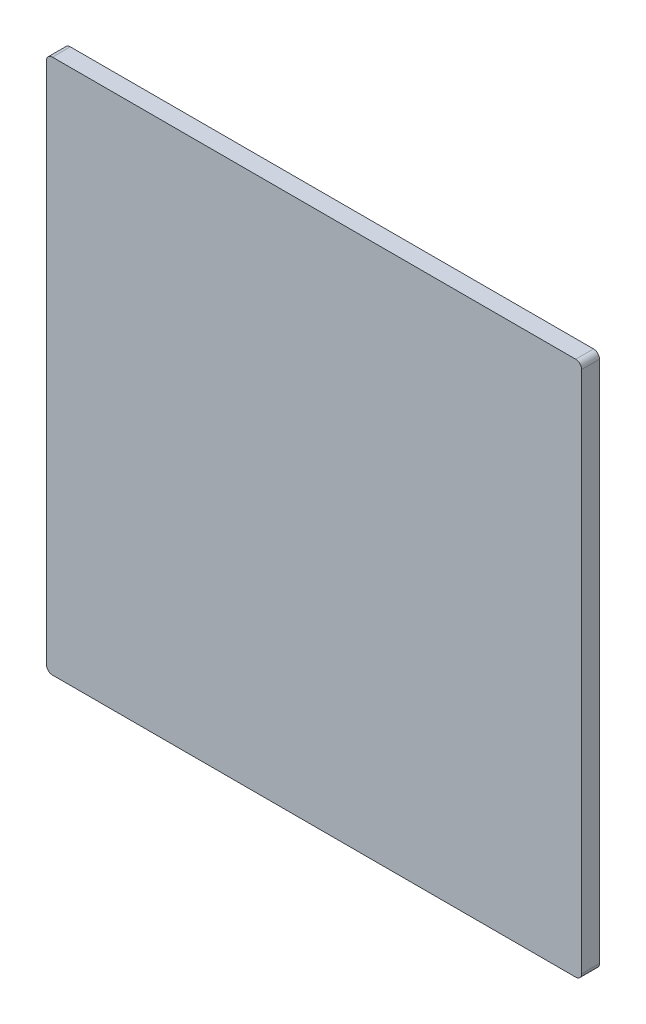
ISO-10303-21;
HEADER;
FILE_DESCRIPTION(('STEP AP214'),'2;1');
FILE_NAME('part.step','',(''),(''),'','','');
FILE_SCHEMA(('AUTOMOTIVE_DESIGN { 1 0 10303 214 1 1 1 1 }'));
ENDSEC;
DATA;
#1=APPLICATION_CONTEXT('core data for automotive mechanical design processes');
#2=APPLICATION_PROTOCOL_DEFINITION('international standard','automotive_design',2000,#1);
#3=PRODUCT_CONTEXT('',#1,'mechanical');
#4=PRODUCT('Part','Part','',(#3));
#5=PRODUCT_RELATED_PRODUCT_CATEGORY('part','',(#4));
#6=PRODUCT_DEFINITION_FORMATION('','',#4);
#7=PRODUCT_DEFINITION_CONTEXT('part definition',#1,'design');
#8=PRODUCT_DEFINITION('design','',#6,#7);
#9=PRODUCT_DEFINITION_SHAPE('','',#8);
#10=(LENGTH_UNIT() NAMED_UNIT(*) SI_UNIT(.MILLI.,.METRE.));
#11=(NAMED_UNIT(*) PLANE_ANGLE_UNIT() SI_UNIT($,.RADIAN.));
#12=(NAMED_UNIT(*) SI_UNIT($,.STERADIAN.) SOLID_ANGLE_UNIT());
#13=UNCERTAINTY_MEASURE_WITH_UNIT(LENGTH_MEASURE(1.E-05),#10,'distance_accuracy_value','');
#14=(GEOMETRIC_REPRESENTATION_CONTEXT(3) GLOBAL_UNCERTAINTY_ASSIGNED_CONTEXT((#13)) GLOBAL_UNIT_ASSIGNED_CONTEXT((#10,
#11,#12)) REPRESENTATION_CONTEXT('',''));
#15=CARTESIAN_POINT('',(0.,0.,0.));
#16=DIRECTION('',(0.,0.,1.));
#17=DIRECTION('',(1.,0.,0.));
#18=AXIS2_PLACEMENT_3D('',#15,#16,#17);
#19=CARTESIAN_POINT('',(114.3,-114.3,7.62));
#20=DIRECTION('',(-1.,0.,0.));
#21=DIRECTION('',(0.,0.,1.));
#22=AXIS2_PLACEMENT_3D('',#19,#20,#21);
#23=PLANE('',#22);
#24=DIRECTION('',(0.,1.,0.));
#25=VECTOR('',#24,1.);
#26=CARTESIAN_POINT('',(114.3,-114.3,7.62));
#27=LINE('',#26,#25);
#28=CARTESIAN_POINT('',(114.3,-111.76,7.62));
#29=VERTEX_POINT('',#28);
#30=CARTESIAN_POINT('',(114.3,111.76,7.62));
#31=VERTEX_POINT('',#30);
#32=EDGE_CURVE('E134',#29,#31,#27,.T.);
#33=ORIENTED_EDGE('',*,*,#32,.F.);
#34=DIRECTION('',(0.,0.,-1.));
#35=VECTOR('',#34,1.);
#36=CARTESIAN_POINT('',(114.3,-111.76,7.62));
#37=LINE('',#36,#35);
#38=CARTESIAN_POINT('',(114.3,-111.76,0.));
#39=VERTEX_POINT('',#38);
#40=EDGE_CURVE('E173',#29,#39,#37,.T.);
#41=ORIENTED_EDGE('',*,*,#40,.T.);
#42=DIRECTION('',(0.,1.,0.));
#43=VECTOR('',#42,1.);
#44=CARTESIAN_POINT('',(114.3,-114.3,0.));
#45=LINE('',#44,#43);
#46=CARTESIAN_POINT('',(114.3,111.76,0.));
#47=VERTEX_POINT('',#46);
#48=EDGE_CURVE('E184',#39,#47,#45,.T.);
#49=ORIENTED_EDGE('',*,*,#48,.T.);
#50=DIRECTION('',(0.,0.,-1.));
#51=VECTOR('',#50,1.);
#52=CARTESIAN_POINT('',(114.3,111.76,7.62));
#53=LINE('',#52,#51);
#54=EDGE_CURVE('E170',#47,#31,#53,.F.);
#55=ORIENTED_EDGE('',*,*,#54,.T.);
#56=EDGE_LOOP('',(#33,#41,#49,#55));
#57=FACE_BOUND('',#56,.T.);
#58=ADVANCED_FACE('F39',(#57),#23,.F.);
#59=CARTESIAN_POINT('',(-114.3,114.3,7.62));
#60=DIRECTION('',(0.,-1.,0.));
#61=DIRECTION('',(0.,0.,-1.));
#62=AXIS2_PLACEMENT_3D('',#59,#60,#61);
#63=PLANE('',#62);
#64=DIRECTION('',(-1.,0.,0.));
#65=VECTOR('',#64,1.);
#66=CARTESIAN_POINT('',(-114.3,114.3,0.));
#67=LINE('',#66,#65);
#68=CARTESIAN_POINT('',(111.76,114.3,0.));
#69=VERTEX_POINT('',#68);
#70=CARTESIAN_POINT('',(-111.76,114.3,0.));
#71=VERTEX_POINT('',#70);
#72=EDGE_CURVE('E141',#69,#71,#67,.T.);
#73=ORIENTED_EDGE('',*,*,#72,.T.);
#74=DIRECTION('',(0.,0.,-1.));
#75=VECTOR('',#74,1.);
#76=CARTESIAN_POINT('',(-111.76,114.3,7.62));
#77=LINE('',#76,#75);
#78=CARTESIAN_POINT('',(-111.76,114.3,7.62));
#79=VERTEX_POINT('',#78);
#80=EDGE_CURVE('E11',#71,#79,#77,.F.);
#81=ORIENTED_EDGE('',*,*,#80,.T.);
#82=DIRECTION('',(-1.,0.,0.));
#83=VECTOR('',#82,1.);
#84=CARTESIAN_POINT('',(-114.3,114.3,7.62));
#85=LINE('',#84,#83);
#86=CARTESIAN_POINT('',(111.76,114.3,7.62));
#87=VERTEX_POINT('',#86);
#88=EDGE_CURVE('E139',#87,#79,#85,.T.);
#89=ORIENTED_EDGE('',*,*,#88,.F.);
#90=DIRECTION('',(0.,0.,-1.));
#91=VECTOR('',#90,1.);
#92=CARTESIAN_POINT('',(111.76,114.3,7.62));
#93=LINE('',#92,#91);
#94=EDGE_CURVE('E48',#87,#69,#93,.T.);
#95=ORIENTED_EDGE('',*,*,#94,.T.);
#96=EDGE_LOOP('',(#73,#81,#89,#95));
#97=FACE_BOUND('',#96,.T.);
#98=ADVANCED_FACE('F180',(#97),#63,.F.);
#99=CARTESIAN_POINT('',(-114.3,-114.3,7.62));
#100=DIRECTION('',(1.,0.,0.));
#101=DIRECTION('',(0.,0.,-1.));
#102=AXIS2_PLACEMENT_3D('',#99,#100,#101);
#103=PLANE('',#102);
#104=DIRECTION('',(0.,-1.,0.));
#105=VECTOR('',#104,1.);
#106=CARTESIAN_POINT('',(-114.3,-114.3,0.));
#107=LINE('',#106,#105);
#108=CARTESIAN_POINT('',(-114.3,111.76,0.));
#109=VERTEX_POINT('',#108);
#110=CARTESIAN_POINT('',(-114.3,-111.76,0.));
#111=VERTEX_POINT('',#110);
#112=EDGE_CURVE('E135',#109,#111,#107,.T.);
#113=ORIENTED_EDGE('',*,*,#112,.T.);
#114=DIRECTION('',(0.,0.,-1.));
#115=VECTOR('',#114,1.);
#116=CARTESIAN_POINT('',(-114.3,-111.76,7.62));
#117=LINE('',#116,#115);
#118=CARTESIAN_POINT('',(-114.3,-111.76,7.62));
#119=VERTEX_POINT('',#118);
#120=EDGE_CURVE('E110',#111,#119,#117,.F.);
#121=ORIENTED_EDGE('',*,*,#120,.T.);
#122=DIRECTION('',(0.,-1.,0.));
#123=VECTOR('',#122,1.);
#124=CARTESIAN_POINT('',(-114.3,-114.3,7.62));
#125=LINE('',#124,#123);
#126=CARTESIAN_POINT('',(-114.3,111.76,7.62));
#127=VERTEX_POINT('',#126);
#128=EDGE_CURVE('E190',#127,#119,#125,.T.);
#129=ORIENTED_EDGE('',*,*,#128,.F.);
#130=DIRECTION('',(0.,0.,-1.));
#131=VECTOR('',#130,1.);
#132=CARTESIAN_POINT('',(-114.3,111.76,7.62));
#133=LINE('',#132,#131);
#134=EDGE_CURVE('E116',#127,#109,#133,.T.);
#135=ORIENTED_EDGE('',*,*,#134,.T.);
#136=EDGE_LOOP('',(#113,#121,#129,#135));
#137=FACE_BOUND('',#136,.T.);
#138=ADVANCED_FACE('F202',(#137),#103,.F.);
#139=CARTESIAN_POINT('',(-114.3,-114.3,7.62));
#140=DIRECTION('',(0.,1.,0.));
#141=DIRECTION('',(0.,0.,1.));
#142=AXIS2_PLACEMENT_3D('',#139,#140,#141);
#143=PLANE('',#142);
#144=DIRECTION('',(1.,0.,0.));
#145=VECTOR('',#144,1.);
#146=CARTESIAN_POINT('',(-114.3,-114.3,7.62));
#147=LINE('',#146,#145);
#148=CARTESIAN_POINT('',(-111.76,-114.3,7.62));
#149=VERTEX_POINT('',#148);
#150=CARTESIAN_POINT('',(111.76,-114.3,7.62));
#151=VERTEX_POINT('',#150);
#152=EDGE_CURVE('E126',#149,#151,#147,.T.);
#153=ORIENTED_EDGE('',*,*,#152,.F.);
#154=DIRECTION('',(0.,0.,-1.));
#155=VECTOR('',#154,1.);
#156=CARTESIAN_POINT('',(-111.76,-114.3,7.62));
#157=LINE('',#156,#155);
#158=CARTESIAN_POINT('',(-111.76,-114.3,0.));
#159=VERTEX_POINT('',#158);
#160=EDGE_CURVE('E109',#149,#159,#157,.T.);
#161=ORIENTED_EDGE('',*,*,#160,.T.);
#162=DIRECTION('',(1.,0.,0.));
#163=VECTOR('',#162,1.);
#164=CARTESIAN_POINT('',(-114.3,-114.3,0.));
#165=LINE('',#164,#163);
#166=CARTESIAN_POINT('',(111.76,-114.3,0.));
#167=VERTEX_POINT('',#166);
#168=EDGE_CURVE('E123',#159,#167,#165,.T.);
#169=ORIENTED_EDGE('',*,*,#168,.T.);
#170=DIRECTION('',(0.,0.,-1.));
#171=VECTOR('',#170,1.);
#172=CARTESIAN_POINT('',(111.76,-114.3,7.62));
#173=LINE('',#172,#171);
#174=EDGE_CURVE('E129',#167,#151,#173,.F.);
#175=ORIENTED_EDGE('',*,*,#174,.T.);
#176=EDGE_LOOP('',(#153,#161,#169,#175));
#177=FACE_BOUND('',#176,.T.);
#178=ADVANCED_FACE('F122',(#177),#143,.F.);
#179=CARTESIAN_POINT('',(0.,0.,7.62));
#180=DIRECTION('',(0.,0.,-1.));
#181=DIRECTION('',(-1.,0.,0.));
#182=AXIS2_PLACEMENT_3D('',#179,#180,#181);
#183=PLANE('',#182);
#184=ORIENTED_EDGE('',*,*,#128,.T.);
#185=CARTESIAN_POINT('',(-111.76,-111.76,7.62));
#186=DIRECTION('',(0.,0.,-1.));
#187=DIRECTION('',(-1.,0.,0.));
#188=AXIS2_PLACEMENT_3D('',#185,#186,#187);
#189=CIRCLE('',#188,2.54);
#190=EDGE_CURVE('E167',#119,#149,#189,.F.);
#191=ORIENTED_EDGE('',*,*,#190,.T.);
#192=ORIENTED_EDGE('',*,*,#152,.T.);
#193=CARTESIAN_POINT('',(111.76,-111.76,7.62));
#194=DIRECTION('',(0.,0.,-1.));
#195=DIRECTION('',(-1.,0.,0.));
#196=AXIS2_PLACEMENT_3D('',#193,#194,#195);
#197=CIRCLE('',#196,2.54);
#198=EDGE_CURVE('E164',#151,#29,#197,.F.);
#199=ORIENTED_EDGE('',*,*,#198,.T.);
#200=ORIENTED_EDGE('',*,*,#32,.T.);
#201=CARTESIAN_POINT('',(111.76,111.76,7.62));
#202=DIRECTION('',(0.,0.,-1.));
#203=DIRECTION('',(-1.,0.,0.));
#204=AXIS2_PLACEMENT_3D('',#201,#202,#203);
#205=CIRCLE('',#204,2.54);
#206=EDGE_CURVE('E60',#31,#87,#205,.F.);
#207=ORIENTED_EDGE('',*,*,#206,.T.);
#208=ORIENTED_EDGE('',*,*,#88,.T.);
#209=CARTESIAN_POINT('',(-111.76,111.76,7.62));
#210=DIRECTION('',(0.,0.,-1.));
#211=DIRECTION('',(-1.,0.,0.));
#212=AXIS2_PLACEMENT_3D('',#209,#210,#211);
#213=CIRCLE('',#212,2.54);
#214=EDGE_CURVE('E161',#79,#127,#213,.F.);
#215=ORIENTED_EDGE('',*,*,#214,.T.);
#216=EDGE_LOOP('',(#184,#191,#192,#199,#200,#207,#208,#215));
#217=FACE_BOUND('',#216,.T.);
#218=ADVANCED_FACE('F196',(#217),#183,.F.);
#219=CARTESIAN_POINT('',(0.,0.,0.));
#220=DIRECTION('',(0.,0.,-1.));
#221=DIRECTION('',(-1.,0.,0.));
#222=AXIS2_PLACEMENT_3D('',#219,#220,#221);
#223=PLANE('',#222);
#224=ORIENTED_EDGE('',*,*,#168,.F.);
#225=CARTESIAN_POINT('',(-111.76,-111.76,0.));
#226=DIRECTION('',(0.,0.,-1.));
#227=DIRECTION('',(-1.,0.,0.));
#228=AXIS2_PLACEMENT_3D('',#225,#226,#227);
#229=CIRCLE('',#228,2.54);
#230=EDGE_CURVE('E105',#159,#111,#229,.T.);
#231=ORIENTED_EDGE('',*,*,#230,.T.);
#232=ORIENTED_EDGE('',*,*,#112,.F.);
#233=CARTESIAN_POINT('',(-111.76,111.76,0.));
#234=DIRECTION('',(0.,0.,-1.));
#235=DIRECTION('',(-1.,0.,0.));
#236=AXIS2_PLACEMENT_3D('',#233,#234,#235);
#237=CIRCLE('',#236,2.54);
#238=EDGE_CURVE('E149',#109,#71,#237,.T.);
#239=ORIENTED_EDGE('',*,*,#238,.T.);
#240=ORIENTED_EDGE('',*,*,#72,.F.);
#241=CARTESIAN_POINT('',(111.76,111.76,0.));
#242=DIRECTION('',(0.,0.,-1.));
#243=DIRECTION('',(-1.,0.,0.));
#244=AXIS2_PLACEMENT_3D('',#241,#242,#243);
#245=CIRCLE('',#244,2.54);
#246=EDGE_CURVE('E128',#69,#47,#245,.T.);
#247=ORIENTED_EDGE('',*,*,#246,.T.);
#248=ORIENTED_EDGE('',*,*,#48,.F.);
#249=CARTESIAN_POINT('',(111.76,-111.76,0.));
#250=DIRECTION('',(0.,0.,-1.));
#251=DIRECTION('',(-1.,0.,0.));
#252=AXIS2_PLACEMENT_3D('',#249,#250,#251);
#253=CIRCLE('',#252,2.54);
#254=EDGE_CURVE('E117',#39,#167,#253,.T.);
#255=ORIENTED_EDGE('',*,*,#254,.T.);
#256=EDGE_LOOP('',(#224,#231,#232,#239,#240,#247,#248,#255));
#257=FACE_BOUND('',#256,.T.);
#258=ADVANCED_FACE('F131',(#257),#223,.T.);
#259=CARTESIAN_POINT('',(-111.76,-111.76,7.62));
#260=DIRECTION('',(0.,0.,-1.));
#261=DIRECTION('',(-1.,0.,0.));
#262=AXIS2_PLACEMENT_3D('',#259,#260,#261);
#263=CYLINDRICAL_SURFACE('',#262,2.54);
#264=ORIENTED_EDGE('',*,*,#190,.F.);
#265=ORIENTED_EDGE('',*,*,#120,.F.);
#266=ORIENTED_EDGE('',*,*,#230,.F.);
#267=ORIENTED_EDGE('',*,*,#160,.F.);
#268=EDGE_LOOP('',(#264,#265,#266,#267));
#269=FACE_BOUND('',#268,.T.);
#270=ADVANCED_FACE('F108',(#269),#263,.T.);
#271=CARTESIAN_POINT('',(111.76,-111.76,7.62));
#272=DIRECTION('',(0.,0.,-1.));
#273=DIRECTION('',(-1.,0.,0.));
#274=AXIS2_PLACEMENT_3D('',#271,#272,#273);
#275=CYLINDRICAL_SURFACE('',#274,2.54);
#276=ORIENTED_EDGE('',*,*,#198,.F.);
#277=ORIENTED_EDGE('',*,*,#174,.F.);
#278=ORIENTED_EDGE('',*,*,#254,.F.);
#279=ORIENTED_EDGE('',*,*,#40,.F.);
#280=EDGE_LOOP('',(#276,#277,#278,#279));
#281=FACE_BOUND('',#280,.T.);
#282=ADVANCED_FACE('F207',(#281),#275,.T.);
#283=CARTESIAN_POINT('',(-111.76,111.76,7.62));
#284=DIRECTION('',(0.,0.,-1.));
#285=DIRECTION('',(-1.,0.,0.));
#286=AXIS2_PLACEMENT_3D('',#283,#284,#285);
#287=CYLINDRICAL_SURFACE('',#286,2.54);
#288=ORIENTED_EDGE('',*,*,#214,.F.);
#289=ORIENTED_EDGE('',*,*,#80,.F.);
#290=ORIENTED_EDGE('',*,*,#238,.F.);
#291=ORIENTED_EDGE('',*,*,#134,.F.);
#292=EDGE_LOOP('',(#288,#289,#290,#291));
#293=FACE_BOUND('',#292,.T.);
#294=ADVANCED_FACE('F200',(#293),#287,.T.);
#295=CARTESIAN_POINT('',(111.76,111.76,7.62));
#296=DIRECTION('',(0.,0.,-1.));
#297=DIRECTION('',(-1.,0.,0.));
#298=AXIS2_PLACEMENT_3D('',#295,#296,#297);
#299=CYLINDRICAL_SURFACE('',#298,2.54);
#300=ORIENTED_EDGE('',*,*,#206,.F.);
#301=ORIENTED_EDGE('',*,*,#54,.F.);
#302=ORIENTED_EDGE('',*,*,#246,.F.);
#303=ORIENTED_EDGE('',*,*,#94,.F.);
#304=EDGE_LOOP('',(#300,#301,#302,#303));
#305=FACE_BOUND('',#304,.T.);
#306=ADVANCED_FACE('F41',(#305),#299,.T.);
#307=CLOSED_SHELL('',(#58,#98,#138,#178,#218,#258,#270,#282,#294,#306));
#308=MANIFOLD_SOLID_BREP('B2',#307);
#309=ADVANCED_BREP_SHAPE_REPRESENTATION('',(#18,#308),#14);
#310=SHAPE_DEFINITION_REPRESENTATION(#9,#309);
ENDSEC;
END-ISO-10303-21;
